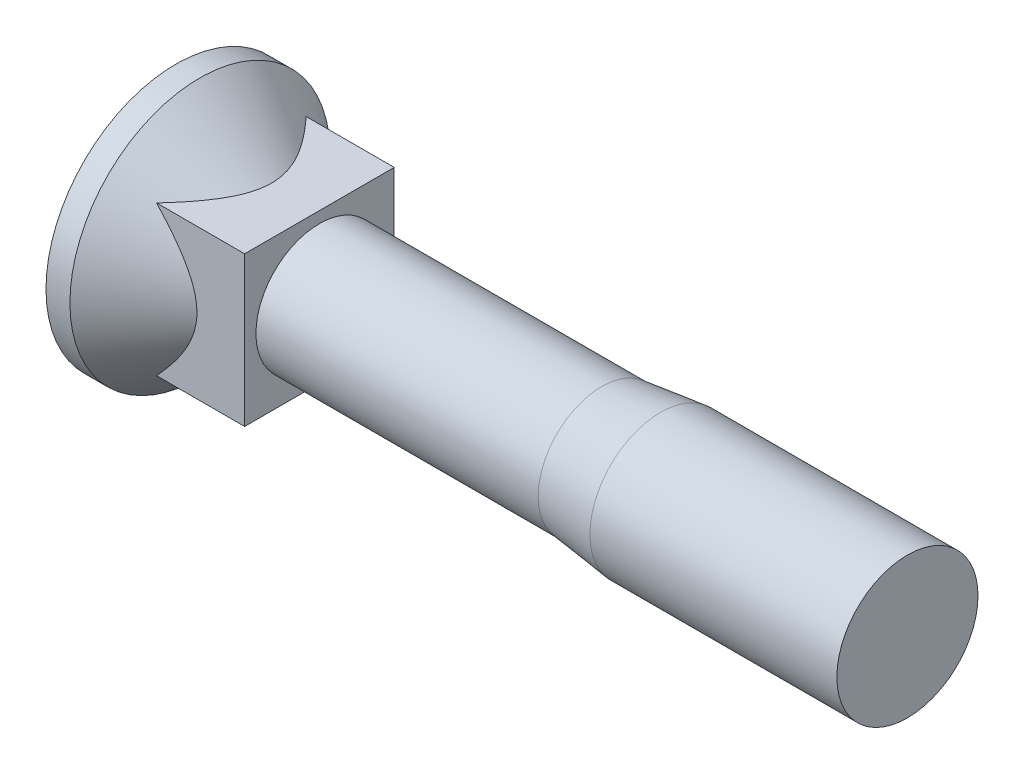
ISO-10303-21;
HEADER;
FILE_DESCRIPTION(('STEP AP214'),'2;1');
FILE_NAME('part.step','',(''),(''),'','','');
FILE_SCHEMA(('AUTOMOTIVE_DESIGN { 1 0 10303 214 1 1 1 1 }'));
ENDSEC;
DATA;
#1=APPLICATION_CONTEXT('core data for automotive mechanical design processes');
#2=APPLICATION_PROTOCOL_DEFINITION('international standard','automotive_design',2000,#1);
#3=PRODUCT_CONTEXT('',#1,'mechanical');
#4=PRODUCT('Part','Part','',(#3));
#5=PRODUCT_RELATED_PRODUCT_CATEGORY('part','',(#4));
#6=PRODUCT_DEFINITION_FORMATION('','',#4);
#7=PRODUCT_DEFINITION_CONTEXT('part definition',#1,'design');
#8=PRODUCT_DEFINITION('design','',#6,#7);
#9=PRODUCT_DEFINITION_SHAPE('','',#8);
#10=(LENGTH_UNIT() NAMED_UNIT(*) SI_UNIT(.MILLI.,.METRE.));
#11=(NAMED_UNIT(*) PLANE_ANGLE_UNIT() SI_UNIT($,.RADIAN.));
#12=(NAMED_UNIT(*) SI_UNIT($,.STERADIAN.) SOLID_ANGLE_UNIT());
#13=UNCERTAINTY_MEASURE_WITH_UNIT(LENGTH_MEASURE(1.E-05),#10,'distance_accuracy_value','');
#14=(GEOMETRIC_REPRESENTATION_CONTEXT(3) GLOBAL_UNCERTAINTY_ASSIGNED_CONTEXT((#13)) GLOBAL_UNIT_ASSIGNED_CONTEXT((#10,
#11,#12)) REPRESENTATION_CONTEXT('',''));
#15=CARTESIAN_POINT('',(0.,0.,0.));
#16=DIRECTION('',(0.,0.,1.));
#17=DIRECTION('',(1.,0.,0.));
#18=AXIS2_PLACEMENT_3D('',#15,#16,#17);
#19=CARTESIAN_POINT('',(6.1,-3.18,-3.18));
#20=DIRECTION('',(1.,0.,0.));
#21=DIRECTION('',(0.,0.,-1.));
#22=AXIS2_PLACEMENT_3D('',#19,#20,#21);
#23=PLANE('',#22);
#24=DIRECTION('',(0.,0.,-1.));
#25=VECTOR('',#24,1.);
#26=CARTESIAN_POINT('',(6.1,-3.18,3.18));
#27=LINE('',#26,#25);
#28=CARTESIAN_POINT('',(6.1,-3.18,3.18));
#29=VERTEX_POINT('',#28);
#30=CARTESIAN_POINT('',(6.1,-3.18,-3.18));
#31=VERTEX_POINT('',#30);
#32=EDGE_CURVE('E91',#29,#31,#27,.T.);
#33=ORIENTED_EDGE('',*,*,#32,.T.);
#34=DIRECTION('',(0.,1.,0.));
#35=VECTOR('',#34,1.);
#36=CARTESIAN_POINT('',(6.1,-3.18,-3.18));
#37=LINE('',#36,#35);
#38=CARTESIAN_POINT('',(6.1,3.18,-3.18));
#39=VERTEX_POINT('',#38);
#40=EDGE_CURVE('E98',#31,#39,#37,.T.);
#41=ORIENTED_EDGE('',*,*,#40,.T.);
#42=DIRECTION('',(0.,0.,1.));
#43=VECTOR('',#42,1.);
#44=CARTESIAN_POINT('',(6.1,3.18,-3.18));
#45=LINE('',#44,#43);
#46=CARTESIAN_POINT('',(6.1,3.18,3.18));
#47=VERTEX_POINT('',#46);
#48=EDGE_CURVE('E104',#39,#47,#45,.T.);
#49=ORIENTED_EDGE('',*,*,#48,.T.);
#50=DIRECTION('',(0.,-1.,0.));
#51=VECTOR('',#50,1.);
#52=CARTESIAN_POINT('',(6.1,3.18,3.18));
#53=LINE('',#52,#51);
#54=EDGE_CURVE('E95',#47,#29,#53,.T.);
#55=ORIENTED_EDGE('',*,*,#54,.T.);
#56=EDGE_LOOP('',(#33,#41,#49,#55));
#57=FACE_BOUND('',#56,.T.);
#58=CARTESIAN_POINT('',(6.09999999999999,0.,0.));
#59=DIRECTION('',(-1.,0.,0.));
#60=DIRECTION('',(0.,0.,1.));
#61=AXIS2_PLACEMENT_3D('',#58,#59,#60);
#62=CIRCLE('',#61,2.7);
#63=CARTESIAN_POINT('',(6.09999999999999,0.,2.7));
#64=VERTEX_POINT('',#63);
#65=EDGE_CURVE('E111',#64,#64,#62,.T.);
#66=ORIENTED_EDGE('',*,*,#65,.T.);
#67=EDGE_LOOP('',(#66));
#68=FACE_BOUND('',#67,.T.);
#69=ADVANCED_FACE('F43',(#57,#68),#23,.T.);
#70=CARTESIAN_POINT('',(7.55451395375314,0.,0.));
#71=DIRECTION('',(-1.,0.,0.));
#72=DIRECTION('',(0.,0.,1.));
#73=AXIS2_PLACEMENT_3D('',#70,#71,#72);
#74=CONICAL_SURFACE('',#73,0.5083333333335,0.654498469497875);
#75=CARTESIAN_POINT('',(-0.587061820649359,-5.96032861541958,-3.18));
#76=CARTESIAN_POINT('',(-0.434250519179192,-5.82740625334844,-3.18));
#77=CARTESIAN_POINT('',(-0.281904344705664,-5.69394400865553,-3.18));
#78=CARTESIAN_POINT('',(0.0216130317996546,-5.42565479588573,-3.18));
#79=CARTESIAN_POINT('',(0.172784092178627,-5.2908276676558,-3.18));
#80=CARTESIAN_POINT('',(0.474411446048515,-5.01888679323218,-3.18));
#81=CARTESIAN_POINT('',(0.624860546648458,-4.8817650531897,-3.18));
#82=CARTESIAN_POINT('',(0.923896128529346,-4.60551969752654,-3.18));
#83=CARTESIAN_POINT('',(1.07248271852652,-4.46639619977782,-3.18));
#84=CARTESIAN_POINT('',(1.37640790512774,-4.17696051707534,-3.18));
#85=CARTESIAN_POINT('',(1.53159514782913,-4.02648880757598,-3.18));
#86=CARTESIAN_POINT('',(1.83838047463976,-3.72194066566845,-3.18));
#87=CARTESIAN_POINT('',(1.98997881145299,-3.56786448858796,-3.18));
#88=CARTESIAN_POINT('',(2.28795853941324,-3.25529776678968,-3.18));
#89=CARTESIAN_POINT('',(2.43434990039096,-3.09681682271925,-3.18));
#90=CARTESIAN_POINT('',(2.64859665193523,-2.85441917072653,-3.18));
#91=CARTESIAN_POINT('',(2.71911133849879,-2.77285399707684,-3.18));
#92=CARTESIAN_POINT('',(2.85796496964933,-2.60789579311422,-3.18));
#93=CARTESIAN_POINT('',(2.92630404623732,-2.52450287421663,-3.18));
#94=CARTESIAN_POINT('',(3.07413489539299,-2.33816653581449,-3.18));
#95=CARTESIAN_POINT('',(3.15301992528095,-2.23473820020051,-3.18));
#96=CARTESIAN_POINT('',(3.3057396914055,-2.02412996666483,-3.18));
#97=CARTESIAN_POINT('',(3.37957244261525,-1.91694861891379,-3.18));
#98=CARTESIAN_POINT('',(3.51994233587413,-1.69898193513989,-3.18));
#99=CARTESIAN_POINT('',(3.58652982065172,-1.58822947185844,-3.18));
#100=CARTESIAN_POINT('',(3.71067784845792,-1.36184489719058,-3.18));
#101=CARTESIAN_POINT('',(3.76824500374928,-1.24621643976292,-3.18));
#102=CARTESIAN_POINT('',(3.88122105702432,-0.986803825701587,-3.18));
#103=CARTESIAN_POINT('',(3.93410952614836,-0.841865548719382,-3.18));
#104=CARTESIAN_POINT('',(3.99582538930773,-0.619704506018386,-3.18));
#105=CARTESIAN_POINT('',(4.01345661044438,-0.544898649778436,-3.18));
#106=CARTESIAN_POINT('',(4.04216313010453,-0.394054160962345,-3.18));
#107=CARTESIAN_POINT('',(4.05324179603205,-0.318016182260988,-3.18));
#108=CARTESIAN_POINT('',(4.06839690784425,-0.164522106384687,-3.18));
#109=CARTESIAN_POINT('',(4.07240718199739,-0.0870593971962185,-3.18));
#110=CARTESIAN_POINT('',(4.07301551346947,0.0678930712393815,-3.18));
#111=CARTESIAN_POINT('',(4.06961382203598,0.145382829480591,-3.18));
#112=CARTESIAN_POINT('',(4.05557098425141,0.299745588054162,-3.18));
#113=CARTESIAN_POINT('',(4.04492515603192,0.376618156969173,-3.18));
#114=CARTESIAN_POINT('',(4.01690678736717,0.529121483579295,-3.18));
#115=CARTESIAN_POINT('',(3.99953301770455,0.604752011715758,-3.18));
#116=CARTESIAN_POINT('',(3.95228844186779,0.778220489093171,-3.18));
#117=CARTESIAN_POINT('',(3.92019941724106,0.875453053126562,-3.18));
#118=CARTESIAN_POINT('',(3.84744106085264,1.06663892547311,-3.18));
#119=CARTESIAN_POINT('',(3.80676753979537,1.1605906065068,-3.18));
#120=CARTESIAN_POINT('',(3.71839117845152,1.34559035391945,-3.18));
#121=CARTESIAN_POINT('',(3.67065868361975,1.43662409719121,-3.18));
#122=CARTESIAN_POINT('',(3.56975924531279,1.61556442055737,-3.18));
#123=CARTESIAN_POINT('',(3.51659363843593,1.70347176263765,-3.18));
#124=CARTESIAN_POINT('',(3.36871070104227,1.93483104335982,-3.18));
#125=CARTESIAN_POINT('',(3.27012998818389,2.07580545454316,-3.18));
#126=CARTESIAN_POINT('',(3.06472533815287,2.35166049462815,-3.18));
#127=CARTESIAN_POINT('',(2.95789524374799,2.48653645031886,-3.18));
#128=CARTESIAN_POINT('',(2.73814807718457,2.75176694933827,-3.18));
#129=CARTESIAN_POINT('',(2.62521659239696,2.88210947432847,-3.18));
#130=CARTESIAN_POINT('',(2.39512654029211,3.13891471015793,-3.18));
#131=CARTESIAN_POINT('',(2.2779691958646,3.26537852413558,-3.18));
#132=CARTESIAN_POINT('',(2.03920912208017,3.5165627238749,-3.18));
#133=CARTESIAN_POINT('',(1.91757265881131,3.64125091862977,-3.18));
#134=CARTESIAN_POINT('',(1.67178358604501,3.88812902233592,-3.18));
#135=CARTESIAN_POINT('',(1.54763082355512,4.01031877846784,-3.18));
#136=CARTESIAN_POINT('',(1.29755607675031,4.25246662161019,-3.18));
#137=CARTESIAN_POINT('',(1.17163723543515,4.37242796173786,-3.18));
#138=CARTESIAN_POINT('',(0.918230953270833,4.61067105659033,-3.18));
#139=CARTESIAN_POINT('',(0.79074356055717,4.72895286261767,-3.18));
#140=CARTESIAN_POINT('',(0.41836371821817,5.07071792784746,-3.18));
#141=CARTESIAN_POINT('',(0.171797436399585,5.29237675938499,-3.18));
#142=CARTESIAN_POINT('',(-0.324555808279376,5.73206478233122,-3.18));
#143=CARTESIAN_POINT('',(-0.574342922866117,5.95009380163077,-3.18));
#144=CARTESIAN_POINT('',(-1.07630406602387,6.38345656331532,-3.18));
#145=CARTESIAN_POINT('',(-1.32847843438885,6.59878991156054,-3.18));
#146=CARTESIAN_POINT('',(-1.83459810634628,7.02736731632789,-3.18));
#147=CARTESIAN_POINT('',(-2.08854342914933,7.24061135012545,-3.18));
#148=CARTESIAN_POINT('',(-2.59811750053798,7.66572519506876,-3.18));
#149=CARTESIAN_POINT('',(-2.85374795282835,7.87759296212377,-3.18));
#150=CARTESIAN_POINT('',(-3.3660920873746,8.30001532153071,-3.18));
#151=CARTESIAN_POINT('',(-3.62280577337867,8.51056990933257,-3.18));
#152=CARTESIAN_POINT('',(-4.39419208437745,9.14061242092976,-3.18));
#153=CARTESIAN_POINT('',(-4.91015683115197,9.55851801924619,-3.18));
#154=CARTESIAN_POINT('',(-5.90660386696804,10.3610193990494,-3.18));
#155=CARTESIAN_POINT('',(-6.38692356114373,10.7458175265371,-3.18));
#156=CARTESIAN_POINT('',(-7.3490257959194,11.5136070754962,-3.18));
#157=CARTESIAN_POINT('',(-7.8308083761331,11.8965984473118,-3.18));
#158=CARTESIAN_POINT('',(-8.79453942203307,12.6604941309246,-3.18));
#159=CARTESIAN_POINT('',(-9.2764858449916,13.04140102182,-3.18));
#160=CARTESIAN_POINT('',(-10.2412041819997,13.8021347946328,-3.18));
#161=CARTESIAN_POINT('',(-10.7239760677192,14.1819617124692,-3.18));
#162=CARTESIAN_POINT('',(-11.2070519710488,14.561400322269,-3.18));
#163=B_SPLINE_CURVE_WITH_KNOTS('',3,(#75,#76,#77,#78,#79,#80,#81,#82,#83,#84,#85,#86,#87,#88,
#89,#90,#91,#92,#93,#94,#95,#96,#97,#98,#99,#100,#101,#102,#103,#104,#105,#106,#107,#108,#109,
#110,#111,#112,#113,#114,#115,#116,#117,#118,#119,#120,#121,#122,#123,#124,#125,#126,#127,#128,
#129,#130,#131,#132,#133,#134,#135,#136,#137,#138,#139,#140,#141,#142,#143,#144,#145,#146,#147,
#148,#149,#150,#151,#152,#153,#154,#155,#156,#157,#158,#159,#160,#161,#162),.UNSPECIFIED.,.F.,
.F.,(4,2,2,2,2,2,2,2,2,2,2,2,2,2,2,2,2,2,2,2,2,2,2,2,2,2,2,2,2,2,2,2,2,2,2,2,2,2,2,2,2,2,2,4),
(0.,0.607603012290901,1.21527816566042,1.82594774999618,2.4365815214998,3.08501233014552,
3.73339734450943,4.38046555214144,4.70389623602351,5.02730725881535,5.41742002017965,
5.80768518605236,6.19503731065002,6.58210414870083,7.04323038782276,7.27355431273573,
7.50375976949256,7.73610910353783,7.96845056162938,8.20094232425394,8.43347658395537,
8.74012953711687,9.04693248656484,9.35506298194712,9.6631178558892,10.1787057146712,
10.6946821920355,11.211935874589,11.7290410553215,12.2515690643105,12.7741289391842,
13.2958540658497,13.8175632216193,14.8121653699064,15.8068145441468,16.8016074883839,
17.7964112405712,18.7924549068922,19.788502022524,21.7804134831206,23.6267537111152,
25.4731443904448,27.3160377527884,29.1588690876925),.UNSPECIFIED.);
#164=CARTESIAN_POINT('',(2.35612284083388,3.18,-3.18));
#165=VERTEX_POINT('',#164);
#166=CARTESIAN_POINT('',(2.35612284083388,-3.18,-3.18));
#167=VERTEX_POINT('',#166);
#168=EDGE_CURVE('E128',#165,#167,#163,.F.);
#169=ORIENTED_EDGE('',*,*,#168,.T.);
#170=CARTESIAN_POINT('',(-0.58706182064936,-3.18,-5.96032861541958));
#171=CARTESIAN_POINT('',(-0.434250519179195,-3.18,-5.82740625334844));
#172=CARTESIAN_POINT('',(-0.281904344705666,-3.18,-5.69394400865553));
#173=CARTESIAN_POINT('',(0.021613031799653,-3.18,-5.42565479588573));
#174=CARTESIAN_POINT('',(0.172784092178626,-3.18,-5.29082766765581));
#175=CARTESIAN_POINT('',(0.474411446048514,-3.18,-5.01888679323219));
#176=CARTESIAN_POINT('',(0.624860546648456,-3.18,-4.8817650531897));
#177=CARTESIAN_POINT('',(0.923896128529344,-3.18,-4.60551969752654));
#178=CARTESIAN_POINT('',(1.07248271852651,-3.18,-4.46639619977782));
#179=CARTESIAN_POINT('',(1.37640790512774,-3.18,-4.17696051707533));
#180=CARTESIAN_POINT('',(1.53159514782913,-3.18,-4.02648880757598));
#181=CARTESIAN_POINT('',(1.83838047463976,-3.18,-3.72194066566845));
#182=CARTESIAN_POINT('',(1.98997881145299,-3.18,-3.56786448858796));
#183=CARTESIAN_POINT('',(2.28795853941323,-3.18,-3.25529776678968));
#184=CARTESIAN_POINT('',(2.43434990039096,-3.18,-3.09681682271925));
#185=CARTESIAN_POINT('',(2.64859665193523,-3.18,-2.85441917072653));
#186=CARTESIAN_POINT('',(2.71911133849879,-3.18,-2.77285399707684));
#187=CARTESIAN_POINT('',(2.85796496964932,-3.18,-2.60789579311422));
#188=CARTESIAN_POINT('',(2.92630404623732,-3.18,-2.52450287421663));
#189=CARTESIAN_POINT('',(3.07413489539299,-3.18,-2.33816653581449));
#190=CARTESIAN_POINT('',(3.15301992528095,-3.18,-2.23473820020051));
#191=CARTESIAN_POINT('',(3.3057396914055,-3.18,-2.02412996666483));
#192=CARTESIAN_POINT('',(3.37957244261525,-3.18,-1.91694861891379));
#193=CARTESIAN_POINT('',(3.51994233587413,-3.18,-1.69898193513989));
#194=CARTESIAN_POINT('',(3.58652982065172,-3.18,-1.58822947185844));
#195=CARTESIAN_POINT('',(3.71067784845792,-3.18,-1.36184489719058));
#196=CARTESIAN_POINT('',(3.76824500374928,-3.18,-1.24621643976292));
#197=CARTESIAN_POINT('',(3.88122105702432,-3.18,-0.986803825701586));
#198=CARTESIAN_POINT('',(3.93410952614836,-3.18,-0.84186554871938));
#199=CARTESIAN_POINT('',(3.99582538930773,-3.18,-0.619704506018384));
#200=CARTESIAN_POINT('',(4.01345661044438,-3.18,-0.544898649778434));
#201=CARTESIAN_POINT('',(4.04216313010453,-3.18,-0.394054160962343));
#202=CARTESIAN_POINT('',(4.05324179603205,-3.18,-0.318016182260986));
#203=CARTESIAN_POINT('',(4.06839690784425,-3.18,-0.164522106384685));
#204=CARTESIAN_POINT('',(4.07240718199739,-3.18,-0.0870593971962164));
#205=CARTESIAN_POINT('',(4.07301551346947,-3.18,0.0678930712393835));
#206=CARTESIAN_POINT('',(4.06961382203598,-3.18,0.145382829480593));
#207=CARTESIAN_POINT('',(4.0555709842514,-3.18,0.299745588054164));
#208=CARTESIAN_POINT('',(4.04492515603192,-3.18,0.376618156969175));
#209=CARTESIAN_POINT('',(4.01690678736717,-3.18,0.529121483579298));
#210=CARTESIAN_POINT('',(3.99953301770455,-3.18,0.60475201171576));
#211=CARTESIAN_POINT('',(3.95228844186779,-3.18,0.778220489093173));
#212=CARTESIAN_POINT('',(3.92019941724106,-3.18,0.875453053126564));
#213=CARTESIAN_POINT('',(3.84744106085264,-3.18,1.06663892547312));
#214=CARTESIAN_POINT('',(3.80676753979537,-3.18,1.1605906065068));
#215=CARTESIAN_POINT('',(3.71839117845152,-3.18,1.34559035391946));
#216=CARTESIAN_POINT('',(3.67065868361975,-3.18,1.43662409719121));
#217=CARTESIAN_POINT('',(3.56975924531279,-3.18,1.61556442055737));
#218=CARTESIAN_POINT('',(3.51659363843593,-3.18,1.70347176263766));
#219=CARTESIAN_POINT('',(3.36871070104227,-3.18,1.93483104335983));
#220=CARTESIAN_POINT('',(3.27012998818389,-3.18,2.07580545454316));
#221=CARTESIAN_POINT('',(3.06472533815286,-3.18,2.35166049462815));
#222=CARTESIAN_POINT('',(2.95789524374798,-3.18,2.48653645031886));
#223=CARTESIAN_POINT('',(2.73814807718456,-3.18,2.75176694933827));
#224=CARTESIAN_POINT('',(2.62521659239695,-3.18,2.88210947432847));
#225=CARTESIAN_POINT('',(2.3951265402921,-3.18,3.13891471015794));
#226=CARTESIAN_POINT('',(2.2779691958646,-3.18,3.26537852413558));
#227=CARTESIAN_POINT('',(2.03920912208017,-3.18,3.51656272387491));
#228=CARTESIAN_POINT('',(1.9175726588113,-3.18,3.64125091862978));
#229=CARTESIAN_POINT('',(1.671783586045,-3.18,3.88812902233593));
#230=CARTESIAN_POINT('',(1.54763082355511,-3.18,4.01031877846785));
#231=CARTESIAN_POINT('',(1.2975560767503,-3.18,4.2524666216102));
#232=CARTESIAN_POINT('',(1.17163723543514,-3.18,4.37242796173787));
#233=CARTESIAN_POINT('',(0.918230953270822,-3.18,4.61067105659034));
#234=CARTESIAN_POINT('',(0.790743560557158,-3.18,4.72895286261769));
#235=CARTESIAN_POINT('',(0.418363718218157,-3.18,5.07071792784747));
#236=CARTESIAN_POINT('',(0.171797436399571,-3.18,5.292376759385));
#237=CARTESIAN_POINT('',(-0.324555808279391,-3.18,5.73206478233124));
#238=CARTESIAN_POINT('',(-0.574342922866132,-3.18,5.95009380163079));
#239=CARTESIAN_POINT('',(-1.07630406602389,-3.18,6.38345656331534));
#240=CARTESIAN_POINT('',(-1.32847843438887,-3.18,6.59878991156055));
#241=CARTESIAN_POINT('',(-1.8345981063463,-3.18,7.02736731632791));
#242=CARTESIAN_POINT('',(-2.08854342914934,-3.18,7.24061135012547));
#243=CARTESIAN_POINT('',(-2.598117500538,-3.18,7.66572519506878));
#244=CARTESIAN_POINT('',(-2.85374795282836,-3.18,7.87759296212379));
#245=CARTESIAN_POINT('',(-3.36609208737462,-3.18,8.30001532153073));
#246=CARTESIAN_POINT('',(-3.62280577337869,-3.18,8.51056990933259));
#247=CARTESIAN_POINT('',(-4.39419208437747,-3.18,9.14061242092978));
#248=CARTESIAN_POINT('',(-4.91015683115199,-3.18,9.55851801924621));
#249=CARTESIAN_POINT('',(-5.90660386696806,-3.18,10.3610193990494));
#250=CARTESIAN_POINT('',(-6.38692356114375,-3.18,10.7458175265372));
#251=CARTESIAN_POINT('',(-7.34902579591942,-3.18,11.5136070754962));
#252=CARTESIAN_POINT('',(-7.83080837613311,-3.18,11.8965984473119));
#253=CARTESIAN_POINT('',(-8.79453942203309,-3.18,12.6604941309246));
#254=CARTESIAN_POINT('',(-9.27648584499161,-3.18,13.0414010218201));
#255=CARTESIAN_POINT('',(-10.2412041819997,-3.18,13.8021347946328));
#256=CARTESIAN_POINT('',(-10.7239760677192,-3.18,14.1819617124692));
#257=CARTESIAN_POINT('',(-11.2070519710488,-3.18,14.561400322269));
#258=B_SPLINE_CURVE_WITH_KNOTS('',3,(#170,#171,#172,#173,#174,#175,#176,#177,#178,#179,#180,
#181,#182,#183,#184,#185,#186,#187,#188,#189,#190,#191,#192,#193,#194,#195,#196,#197,#198,#199,
#200,#201,#202,#203,#204,#205,#206,#207,#208,#209,#210,#211,#212,#213,#214,#215,#216,#217,#218,
#219,#220,#221,#222,#223,#224,#225,#226,#227,#228,#229,#230,#231,#232,#233,#234,#235,#236,#237,
#238,#239,#240,#241,#242,#243,#244,#245,#246,#247,#248,#249,#250,#251,#252,#253,#254,#255,#256,
#257),.UNSPECIFIED.,.F.,.F.,(4,2,2,2,2,2,2,2,2,2,2,2,2,2,2,2,2,2,2,2,2,2,2,2,2,2,2,2,2,2,2,2,2,
2,2,2,2,2,2,2,2,2,2,4),(0.,0.607603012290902,1.21527816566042,1.82594774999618,2.4365815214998,
3.08501233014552,3.73339734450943,4.38046555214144,4.70389623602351,5.02730725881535,
5.41742002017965,5.80768518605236,6.19503731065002,6.58210414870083,7.04323038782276,
7.27355431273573,7.50375976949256,7.73610910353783,7.96845056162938,8.20094232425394,
8.43347658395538,8.74012953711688,9.04693248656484,9.35506298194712,9.66311785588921,
10.1787057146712,10.6946821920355,11.211935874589,11.7290410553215,12.2515690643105,
12.7741289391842,13.2958540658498,13.8175632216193,14.8121653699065,15.8068145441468,
16.8016074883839,17.7964112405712,18.7924549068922,19.788502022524,21.7804134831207,
23.6267537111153,25.4731443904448,27.3160377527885,29.1588690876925),.UNSPECIFIED.);
#259=CARTESIAN_POINT('',(2.35612284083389,-3.18,3.18));
#260=VERTEX_POINT('',#259);
#261=EDGE_CURVE('E11',#167,#260,#258,.T.);
#262=ORIENTED_EDGE('',*,*,#261,.T.);
#263=CARTESIAN_POINT('',(-0.587061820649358,-5.96032861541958,3.18));
#264=CARTESIAN_POINT('',(-0.434250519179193,-5.82740625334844,3.18));
#265=CARTESIAN_POINT('',(-0.281904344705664,-5.69394400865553,3.18));
#266=CARTESIAN_POINT('',(0.0216130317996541,-5.42565479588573,3.18));
#267=CARTESIAN_POINT('',(0.172784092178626,-5.29082766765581,3.18));
#268=CARTESIAN_POINT('',(0.474411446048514,-5.01888679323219,3.18));
#269=CARTESIAN_POINT('',(0.624860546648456,-4.8817650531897,3.18));
#270=CARTESIAN_POINT('',(0.923896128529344,-4.60551969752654,3.18));
#271=CARTESIAN_POINT('',(1.07248271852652,-4.46639619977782,3.18));
#272=CARTESIAN_POINT('',(1.37640790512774,-4.17696051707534,3.18));
#273=CARTESIAN_POINT('',(1.53159514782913,-4.02648880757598,3.18));
#274=CARTESIAN_POINT('',(1.83838047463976,-3.72194066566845,3.18));
#275=CARTESIAN_POINT('',(1.98997881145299,-3.56786448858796,3.18));
#276=CARTESIAN_POINT('',(2.28795853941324,-3.25529776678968,3.18));
#277=CARTESIAN_POINT('',(2.43434990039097,-3.09681682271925,3.18));
#278=CARTESIAN_POINT('',(2.64859665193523,-2.85441917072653,3.18));
#279=CARTESIAN_POINT('',(2.71911133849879,-2.77285399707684,3.18));
#280=CARTESIAN_POINT('',(2.85796496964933,-2.60789579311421,3.18));
#281=CARTESIAN_POINT('',(2.92630404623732,-2.52450287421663,3.18));
#282=CARTESIAN_POINT('',(3.07413489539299,-2.33816653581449,3.18));
#283=CARTESIAN_POINT('',(3.15301992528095,-2.23473820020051,3.18));
#284=CARTESIAN_POINT('',(3.3057396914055,-2.02412996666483,3.18));
#285=CARTESIAN_POINT('',(3.37957244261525,-1.91694861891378,3.18));
#286=CARTESIAN_POINT('',(3.51994233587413,-1.69898193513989,3.18));
#287=CARTESIAN_POINT('',(3.58652982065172,-1.58822947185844,3.18));
#288=CARTESIAN_POINT('',(3.71067784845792,-1.36184489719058,3.18));
#289=CARTESIAN_POINT('',(3.76824500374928,-1.24621643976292,3.18));
#290=CARTESIAN_POINT('',(3.88122105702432,-0.986803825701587,3.18));
#291=CARTESIAN_POINT('',(3.93410952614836,-0.841865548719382,3.18));
#292=CARTESIAN_POINT('',(3.99582538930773,-0.619704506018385,3.18));
#293=CARTESIAN_POINT('',(4.01345661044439,-0.544898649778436,3.18));
#294=CARTESIAN_POINT('',(4.04216313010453,-0.394054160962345,3.18));
#295=CARTESIAN_POINT('',(4.05324179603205,-0.318016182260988,3.18));
#296=CARTESIAN_POINT('',(4.06839690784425,-0.164522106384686,3.18));
#297=CARTESIAN_POINT('',(4.07240718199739,-0.0870593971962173,3.18));
#298=CARTESIAN_POINT('',(4.07301551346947,0.0678930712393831,3.18));
#299=CARTESIAN_POINT('',(4.06961382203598,0.145382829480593,3.18));
#300=CARTESIAN_POINT('',(4.05557098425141,0.299745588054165,3.18));
#301=CARTESIAN_POINT('',(4.04492515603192,0.376618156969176,3.18));
#302=CARTESIAN_POINT('',(4.01690678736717,0.529121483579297,3.18));
#303=CARTESIAN_POINT('',(3.99953301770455,0.60475201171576,3.18));
#304=CARTESIAN_POINT('',(3.95228844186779,0.778220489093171,3.18));
#305=CARTESIAN_POINT('',(3.92019941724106,0.875453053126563,3.18));
#306=CARTESIAN_POINT('',(3.84744106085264,1.06663892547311,3.18));
#307=CARTESIAN_POINT('',(3.80676753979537,1.1605906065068,3.18));
#308=CARTESIAN_POINT('',(3.71839117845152,1.34559035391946,3.18));
#309=CARTESIAN_POINT('',(3.67065868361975,1.43662409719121,3.18));
#310=CARTESIAN_POINT('',(3.56975924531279,1.61556442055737,3.18));
#311=CARTESIAN_POINT('',(3.51659363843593,1.70347176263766,3.18));
#312=CARTESIAN_POINT('',(3.36871070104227,1.93483104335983,3.18));
#313=CARTESIAN_POINT('',(3.27012998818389,2.07580545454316,3.18));
#314=CARTESIAN_POINT('',(3.06472533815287,2.35166049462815,3.18));
#315=CARTESIAN_POINT('',(2.95789524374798,2.48653645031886,3.18));
#316=CARTESIAN_POINT('',(2.73814807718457,2.75176694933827,3.18));
#317=CARTESIAN_POINT('',(2.62521659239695,2.88210947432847,3.18));
#318=CARTESIAN_POINT('',(2.3951265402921,3.13891471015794,3.18));
#319=CARTESIAN_POINT('',(2.2779691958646,3.26537852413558,3.18));
#320=CARTESIAN_POINT('',(2.03920912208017,3.51656272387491,3.18));
#321=CARTESIAN_POINT('',(1.9175726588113,3.64125091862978,3.18));
#322=CARTESIAN_POINT('',(1.671783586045,3.88812902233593,3.18));
#323=CARTESIAN_POINT('',(1.54763082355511,4.01031877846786,3.18));
#324=CARTESIAN_POINT('',(1.2975560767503,4.2524666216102,3.18));
#325=CARTESIAN_POINT('',(1.17163723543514,4.37242796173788,3.18));
#326=CARTESIAN_POINT('',(0.91823095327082,4.61067105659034,3.18));
#327=CARTESIAN_POINT('',(0.790743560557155,4.72895286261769,3.18));
#328=CARTESIAN_POINT('',(0.418363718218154,5.07071792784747,3.18));
#329=CARTESIAN_POINT('',(0.171797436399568,5.29237675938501,3.18));
#330=CARTESIAN_POINT('',(-0.324555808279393,5.73206478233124,3.18));
#331=CARTESIAN_POINT('',(-0.574342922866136,5.95009380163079,3.18));
#332=CARTESIAN_POINT('',(-1.07630406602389,6.38345656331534,3.18));
#333=CARTESIAN_POINT('',(-1.32847843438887,6.59878991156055,3.18));
#334=CARTESIAN_POINT('',(-1.8345981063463,7.0273673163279,3.18));
#335=CARTESIAN_POINT('',(-2.08854342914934,7.24061135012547,3.18));
#336=CARTESIAN_POINT('',(-2.598117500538,7.66572519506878,3.18));
#337=CARTESIAN_POINT('',(-2.85374795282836,7.87759296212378,3.18));
#338=CARTESIAN_POINT('',(-3.36609208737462,8.30001532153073,3.18));
#339=CARTESIAN_POINT('',(-3.62280577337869,8.51056990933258,3.18));
#340=CARTESIAN_POINT('',(-4.39419208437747,9.14061242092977,3.18));
#341=CARTESIAN_POINT('',(-4.91015683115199,9.55851801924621,3.18));
#342=CARTESIAN_POINT('',(-5.90660386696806,10.3610193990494,3.18));
#343=CARTESIAN_POINT('',(-6.38692356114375,10.7458175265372,3.18));
#344=CARTESIAN_POINT('',(-7.34902579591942,11.5136070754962,3.18));
#345=CARTESIAN_POINT('',(-7.83080837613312,11.8965984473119,3.18));
#346=CARTESIAN_POINT('',(-8.79453942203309,12.6604941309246,3.18));
#347=CARTESIAN_POINT('',(-9.27648584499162,13.0414010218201,3.18));
#348=CARTESIAN_POINT('',(-10.2412041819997,13.8021347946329,3.18));
#349=CARTESIAN_POINT('',(-10.7239760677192,14.1819617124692,3.18));
#350=CARTESIAN_POINT('',(-11.2070519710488,14.561400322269,3.18));
#351=B_SPLINE_CURVE_WITH_KNOTS('',3,(#263,#264,#265,#266,#267,#268,#269,#270,#271,#272,#273,
#274,#275,#276,#277,#278,#279,#280,#281,#282,#283,#284,#285,#286,#287,#288,#289,#290,#291,#292,
#293,#294,#295,#296,#297,#298,#299,#300,#301,#302,#303,#304,#305,#306,#307,#308,#309,#310,#311,
#312,#313,#314,#315,#316,#317,#318,#319,#320,#321,#322,#323,#324,#325,#326,#327,#328,#329,#330,
#331,#332,#333,#334,#335,#336,#337,#338,#339,#340,#341,#342,#343,#344,#345,#346,#347,#348,#349,
#350),.UNSPECIFIED.,.F.,.F.,(4,2,2,2,2,2,2,2,2,2,2,2,2,2,2,2,2,2,2,2,2,2,2,2,2,2,2,2,2,2,2,2,2,
2,2,2,2,2,2,2,2,2,2,4),(0.,0.6076030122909,1.21527816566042,1.82594774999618,2.4365815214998,
3.08501233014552,3.73339734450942,4.38046555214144,4.70389623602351,5.02730725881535,
5.41742002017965,5.80768518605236,6.19503731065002,6.58210414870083,7.04323038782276,
7.27355431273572,7.50375976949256,7.73610910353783,7.96845056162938,8.20094232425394,
8.43347658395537,8.74012953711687,9.04693248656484,9.35506298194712,9.6631178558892,
10.1787057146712,10.6946821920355,11.211935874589,11.7290410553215,12.2515690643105,
12.7741289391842,13.2958540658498,13.8175632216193,14.8121653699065,15.8068145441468,
16.801607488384,17.7964112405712,18.7924549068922,19.788502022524,21.7804134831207,
23.6267537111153,25.4731443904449,27.3160377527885,29.1588690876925),.UNSPECIFIED.);
#352=CARTESIAN_POINT('',(2.35612284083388,3.18,3.18));
#353=VERTEX_POINT('',#352);
#354=EDGE_CURVE('E57',#260,#353,#351,.T.);
#355=ORIENTED_EDGE('',*,*,#354,.T.);
#356=CARTESIAN_POINT('',(-0.587061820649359,3.18,-5.96032861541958));
#357=CARTESIAN_POINT('',(-0.434250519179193,3.18,-5.82740625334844));
#358=CARTESIAN_POINT('',(-0.281904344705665,3.18,-5.69394400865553));
#359=CARTESIAN_POINT('',(0.0216130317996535,3.18,-5.42565479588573));
#360=CARTESIAN_POINT('',(0.172784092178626,3.18,-5.29082766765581));
#361=CARTESIAN_POINT('',(0.474411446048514,3.18,-5.01888679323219));
#362=CARTESIAN_POINT('',(0.624860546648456,3.18,-4.8817650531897));
#363=CARTESIAN_POINT('',(0.923896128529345,3.18,-4.60551969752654));
#364=CARTESIAN_POINT('',(1.07248271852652,3.18,-4.46639619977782));
#365=CARTESIAN_POINT('',(1.37640790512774,3.18,-4.17696051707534));
#366=CARTESIAN_POINT('',(1.53159514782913,3.18,-4.02648880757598));
#367=CARTESIAN_POINT('',(1.83838047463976,3.18,-3.72194066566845));
#368=CARTESIAN_POINT('',(1.98997881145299,3.18,-3.56786448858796));
#369=CARTESIAN_POINT('',(2.28795853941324,3.18,-3.25529776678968));
#370=CARTESIAN_POINT('',(2.43434990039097,3.18,-3.09681682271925));
#371=CARTESIAN_POINT('',(2.64859665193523,3.18,-2.85441917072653));
#372=CARTESIAN_POINT('',(2.71911133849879,3.18,-2.77285399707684));
#373=CARTESIAN_POINT('',(2.85796496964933,3.18,-2.60789579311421));
#374=CARTESIAN_POINT('',(2.92630404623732,3.18,-2.52450287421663));
#375=CARTESIAN_POINT('',(3.07413489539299,3.18,-2.33816653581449));
#376=CARTESIAN_POINT('',(3.15301992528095,3.18,-2.23473820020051));
#377=CARTESIAN_POINT('',(3.3057396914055,3.18,-2.02412996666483));
#378=CARTESIAN_POINT('',(3.37957244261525,3.18,-1.91694861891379));
#379=CARTESIAN_POINT('',(3.51994233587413,3.18,-1.69898193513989));
#380=CARTESIAN_POINT('',(3.58652982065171,3.18,-1.58822947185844));
#381=CARTESIAN_POINT('',(3.71067784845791,3.18,-1.36184489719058));
#382=CARTESIAN_POINT('',(3.76824500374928,3.18,-1.24621643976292));
#383=CARTESIAN_POINT('',(3.88122105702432,3.18,-0.986803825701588));
#384=CARTESIAN_POINT('',(3.93410952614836,3.18,-0.841865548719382));
#385=CARTESIAN_POINT('',(3.99582538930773,3.18,-0.619704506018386));
#386=CARTESIAN_POINT('',(4.01345661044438,3.18,-0.544898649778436));
#387=CARTESIAN_POINT('',(4.04216313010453,3.18,-0.394054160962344));
#388=CARTESIAN_POINT('',(4.05324179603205,3.18,-0.318016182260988));
#389=CARTESIAN_POINT('',(4.06839690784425,3.18,-0.164522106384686));
#390=CARTESIAN_POINT('',(4.07240718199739,3.18,-0.0870593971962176));
#391=CARTESIAN_POINT('',(4.07301551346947,3.18,0.0678930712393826));
#392=CARTESIAN_POINT('',(4.06961382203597,3.18,0.145382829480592));
#393=CARTESIAN_POINT('',(4.0555709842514,3.18,0.299745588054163));
#394=CARTESIAN_POINT('',(4.04492515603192,3.18,0.376618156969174));
#395=CARTESIAN_POINT('',(4.01690678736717,3.18,0.529121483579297));
#396=CARTESIAN_POINT('',(3.99953301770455,3.18,0.60475201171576));
#397=CARTESIAN_POINT('',(3.95228844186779,3.18,0.778220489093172));
#398=CARTESIAN_POINT('',(3.92019941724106,3.18,0.875453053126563));
#399=CARTESIAN_POINT('',(3.84744106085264,3.18,1.06663892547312));
#400=CARTESIAN_POINT('',(3.80676753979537,3.18,1.1605906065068));
#401=CARTESIAN_POINT('',(3.71839117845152,3.18,1.34559035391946));
#402=CARTESIAN_POINT('',(3.67065868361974,3.18,1.43662409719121));
#403=CARTESIAN_POINT('',(3.56975924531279,3.18,1.61556442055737));
#404=CARTESIAN_POINT('',(3.51659363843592,3.18,1.70347176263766));
#405=CARTESIAN_POINT('',(3.36871070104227,3.18,1.93483104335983));
#406=CARTESIAN_POINT('',(3.27012998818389,3.18,2.07580545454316));
#407=CARTESIAN_POINT('',(3.06472533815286,3.18,2.35166049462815));
#408=CARTESIAN_POINT('',(2.95789524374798,3.18,2.48653645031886));
#409=CARTESIAN_POINT('',(2.73814807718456,3.18,2.75176694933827));
#410=CARTESIAN_POINT('',(2.62521659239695,3.18,2.88210947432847));
#411=CARTESIAN_POINT('',(2.3951265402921,3.18,3.13891471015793));
#412=CARTESIAN_POINT('',(2.27796919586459,3.18,3.26537852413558));
#413=CARTESIAN_POINT('',(2.03920912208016,3.18,3.51656272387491));
#414=CARTESIAN_POINT('',(1.9175726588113,3.18,3.64125091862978));
#415=CARTESIAN_POINT('',(1.671783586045,3.18,3.88812902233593));
#416=CARTESIAN_POINT('',(1.54763082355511,3.18,4.01031877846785));
#417=CARTESIAN_POINT('',(1.2975560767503,3.18,4.2524666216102));
#418=CARTESIAN_POINT('',(1.17163723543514,3.18,4.37242796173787));
#419=CARTESIAN_POINT('',(0.91823095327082,3.18,4.61067105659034));
#420=CARTESIAN_POINT('',(0.790743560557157,3.18,4.72895286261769));
#421=CARTESIAN_POINT('',(0.418363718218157,3.18,5.07071792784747));
#422=CARTESIAN_POINT('',(0.171797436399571,3.18,5.292376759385));
#423=CARTESIAN_POINT('',(-0.32455580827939,3.18,5.73206478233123));
#424=CARTESIAN_POINT('',(-0.574342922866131,3.18,5.95009380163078));
#425=CARTESIAN_POINT('',(-1.07630406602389,3.18,6.38345656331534));
#426=CARTESIAN_POINT('',(-1.32847843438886,3.18,6.59878991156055));
#427=CARTESIAN_POINT('',(-1.83459810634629,3.18,7.0273673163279));
#428=CARTESIAN_POINT('',(-2.08854342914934,3.18,7.24061135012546));
#429=CARTESIAN_POINT('',(-2.59811750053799,3.18,7.66572519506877));
#430=CARTESIAN_POINT('',(-2.85374795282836,3.18,7.87759296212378));
#431=CARTESIAN_POINT('',(-3.36609208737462,3.18,8.30001532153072));
#432=CARTESIAN_POINT('',(-3.62280577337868,3.18,8.51056990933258));
#433=CARTESIAN_POINT('',(-4.39419208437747,3.18,9.14061242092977));
#434=CARTESIAN_POINT('',(-4.91015683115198,3.18,9.5585180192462));
#435=CARTESIAN_POINT('',(-5.90660386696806,3.18,10.3610193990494));
#436=CARTESIAN_POINT('',(-6.38692356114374,3.18,10.7458175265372));
#437=CARTESIAN_POINT('',(-7.34902579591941,3.18,11.5136070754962));
#438=CARTESIAN_POINT('',(-7.83080837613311,3.18,11.8965984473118));
#439=CARTESIAN_POINT('',(-8.79453942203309,3.18,12.6604941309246));
#440=CARTESIAN_POINT('',(-9.27648584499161,3.18,13.0414010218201));
#441=CARTESIAN_POINT('',(-10.2412041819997,3.18,13.8021347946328));
#442=CARTESIAN_POINT('',(-10.7239760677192,3.18,14.1819617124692));
#443=CARTESIAN_POINT('',(-11.2070519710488,3.18,14.561400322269));
#444=B_SPLINE_CURVE_WITH_KNOTS('',3,(#356,#357,#358,#359,#360,#361,#362,#363,#364,#365,#366,
#367,#368,#369,#370,#371,#372,#373,#374,#375,#376,#377,#378,#379,#380,#381,#382,#383,#384,#385,
#386,#387,#388,#389,#390,#391,#392,#393,#394,#395,#396,#397,#398,#399,#400,#401,#402,#403,#404,
#405,#406,#407,#408,#409,#410,#411,#412,#413,#414,#415,#416,#417,#418,#419,#420,#421,#422,#423,
#424,#425,#426,#427,#428,#429,#430,#431,#432,#433,#434,#435,#436,#437,#438,#439,#440,#441,#442,
#443),.UNSPECIFIED.,.F.,.F.,(4,2,2,2,2,2,2,2,2,2,2,2,2,2,2,2,2,2,2,2,2,2,2,2,2,2,2,2,2,2,2,2,2,
2,2,2,2,2,2,2,2,2,2,4),(0.,0.6076030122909,1.21527816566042,1.82594774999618,2.4365815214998,
3.08501233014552,3.73339734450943,4.38046555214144,4.70389623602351,5.02730725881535,
5.41742002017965,5.80768518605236,6.19503731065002,6.58210414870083,7.04323038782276,
7.27355431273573,7.50375976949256,7.73610910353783,7.96845056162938,8.20094232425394,
8.43347658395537,8.74012953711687,9.04693248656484,9.35506298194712,9.6631178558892,
10.1787057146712,10.6946821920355,11.211935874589,11.7290410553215,12.2515690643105,
12.7741289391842,13.2958540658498,13.8175632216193,14.8121653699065,15.8068145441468,
16.8016074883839,17.7964112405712,18.7924549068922,19.788502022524,21.7804134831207,
23.6267537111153,25.4731443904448,27.3160377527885,29.1588690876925),.UNSPECIFIED.);
#445=EDGE_CURVE('E135',#353,#165,#444,.F.);
#446=ORIENTED_EDGE('',*,*,#445,.T.);
#447=EDGE_LOOP('',(#169,#262,#355,#446));
#448=FACE_BOUND('',#447,.T.);
#449=CARTESIAN_POINT('',(1.01666666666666,0.,0.));
#450=DIRECTION('',(-1.,0.,0.));
#451=DIRECTION('',(0.,0.,1.));
#452=AXIS2_PLACEMENT_3D('',#449,#450,#451);
#453=CIRCLE('',#452,5.525);
#454=CARTESIAN_POINT('',(1.01666666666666,0.,5.525));
#455=VERTEX_POINT('',#454);
#456=EDGE_CURVE('E119',#455,#455,#453,.T.);
#457=ORIENTED_EDGE('',*,*,#456,.F.);
#458=EDGE_LOOP('',(#457));
#459=FACE_BOUND('',#458,.T.);
#460=ADVANCED_FACE('F142',(#448,#459),#74,.T.);
#461=CARTESIAN_POINT('',(0.,5.525,0.));
#462=DIRECTION('',(1.,0.,0.));
#463=DIRECTION('',(0.,0.,-1.));
#464=AXIS2_PLACEMENT_3D('',#461,#462,#463);
#465=PLANE('',#464);
#466=CARTESIAN_POINT('',(0.,0.,0.));
#467=DIRECTION('',(-1.,0.,0.));
#468=DIRECTION('',(0.,0.,1.));
#469=AXIS2_PLACEMENT_3D('',#466,#467,#468);
#470=CIRCLE('',#469,5.525);
#471=CARTESIAN_POINT('',(0.,0.,5.525));
#472=VERTEX_POINT('',#471);
#473=EDGE_CURVE('E125',#472,#472,#470,.T.);
#474=ORIENTED_EDGE('',*,*,#473,.T.);
#475=EDGE_LOOP('',(#474));
#476=FACE_BOUND('',#475,.T.);
#477=ADVANCED_FACE('F45',(#476),#465,.F.);
#478=CARTESIAN_POINT('',(-5.30981033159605,0.,0.));
#479=DIRECTION('',(-1.,0.,0.));
#480=DIRECTION('',(0.,0.,1.));
#481=AXIS2_PLACEMENT_3D('',#478,#479,#480);
#482=CYLINDRICAL_SURFACE('',#481,5.525);
#483=ORIENTED_EDGE('',*,*,#473,.F.);
#484=EDGE_LOOP('',(#483));
#485=FACE_BOUND('',#484,.T.);
#486=ORIENTED_EDGE('',*,*,#456,.T.);
#487=EDGE_LOOP('',(#486));
#488=FACE_BOUND('',#487,.T.);
#489=ADVANCED_FACE('F147',(#485,#488),#482,.T.);
#490=CARTESIAN_POINT('',(-8.99439825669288,-3.18,3.18));
#491=DIRECTION('',(0.,-1.,0.));
#492=DIRECTION('',(0.,0.,-1.));
#493=AXIS2_PLACEMENT_3D('',#490,#491,#492);
#494=PLANE('',#493);
#495=ORIENTED_EDGE('',*,*,#261,.F.);
#496=DIRECTION('',(1.,0.,0.));
#497=VECTOR('',#496,1.);
#498=CARTESIAN_POINT('',(-8.99439825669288,-3.18,-3.18));
#499=LINE('',#498,#497);
#500=EDGE_CURVE('E64',#167,#31,#499,.T.);
#501=ORIENTED_EDGE('',*,*,#500,.T.);
#502=ORIENTED_EDGE('',*,*,#32,.F.);
#503=DIRECTION('',(1.,0.,0.));
#504=VECTOR('',#503,1.);
#505=CARTESIAN_POINT('',(-8.99439825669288,-3.18,3.18));
#506=LINE('',#505,#504);
#507=EDGE_CURVE('E117',#260,#29,#506,.T.);
#508=ORIENTED_EDGE('',*,*,#507,.F.);
#509=EDGE_LOOP('',(#495,#501,#502,#508));
#510=FACE_BOUND('',#509,.T.);
#511=ADVANCED_FACE('F89',(#510),#494,.T.);
#512=CARTESIAN_POINT('',(-8.99439825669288,3.18,3.18));
#513=DIRECTION('',(0.,0.,1.));
#514=DIRECTION('',(0.,-1.,0.));
#515=AXIS2_PLACEMENT_3D('',#512,#513,#514);
#516=PLANE('',#515);
#517=ORIENTED_EDGE('',*,*,#354,.F.);
#518=ORIENTED_EDGE('',*,*,#507,.T.);
#519=ORIENTED_EDGE('',*,*,#54,.F.);
#520=DIRECTION('',(1.,0.,0.));
#521=VECTOR('',#520,1.);
#522=CARTESIAN_POINT('',(-8.99439825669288,3.18,3.18));
#523=LINE('',#522,#521);
#524=EDGE_CURVE('E120',#353,#47,#523,.T.);
#525=ORIENTED_EDGE('',*,*,#524,.F.);
#526=EDGE_LOOP('',(#517,#518,#519,#525));
#527=FACE_BOUND('',#526,.T.);
#528=ADVANCED_FACE('F156',(#527),#516,.T.);
#529=CARTESIAN_POINT('',(-8.99439825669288,3.18,-3.18));
#530=DIRECTION('',(0.,1.,0.));
#531=DIRECTION('',(0.,0.,1.));
#532=AXIS2_PLACEMENT_3D('',#529,#530,#531);
#533=PLANE('',#532);
#534=ORIENTED_EDGE('',*,*,#445,.F.);
#535=ORIENTED_EDGE('',*,*,#524,.T.);
#536=ORIENTED_EDGE('',*,*,#48,.F.);
#537=DIRECTION('',(1.,0.,0.));
#538=VECTOR('',#537,1.);
#539=CARTESIAN_POINT('',(-8.99439825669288,3.18,-3.18));
#540=LINE('',#539,#538);
#541=EDGE_CURVE('E94',#165,#39,#540,.T.);
#542=ORIENTED_EDGE('',*,*,#541,.F.);
#543=EDGE_LOOP('',(#534,#535,#536,#542));
#544=FACE_BOUND('',#543,.T.);
#545=ADVANCED_FACE('F160',(#544),#533,.T.);
#546=CARTESIAN_POINT('',(-8.99439825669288,-3.18,-3.18));
#547=DIRECTION('',(0.,0.,-1.));
#548=DIRECTION('',(-1.,0.,0.));
#549=AXIS2_PLACEMENT_3D('',#546,#547,#548);
#550=PLANE('',#549);
#551=ORIENTED_EDGE('',*,*,#168,.F.);
#552=ORIENTED_EDGE('',*,*,#541,.T.);
#553=ORIENTED_EDGE('',*,*,#40,.F.);
#554=ORIENTED_EDGE('',*,*,#500,.F.);
#555=EDGE_LOOP('',(#551,#552,#553,#554));
#556=FACE_BOUND('',#555,.T.);
#557=ADVANCED_FACE('F99',(#556),#550,.T.);
#558=CARTESIAN_POINT('',(-1.17287104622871,0.,0.));
#559=DIRECTION('',(-1.,0.,0.));
#560=DIRECTION('',(0.,0.,1.));
#561=AXIS2_PLACEMENT_3D('',#558,#559,#560);
#562=CYLINDRICAL_SURFACE('',#561,2.7);
#563=CARTESIAN_POINT('',(18.1,0.,0.));
#564=DIRECTION('',(-1.,0.,0.));
#565=DIRECTION('',(0.,0.,1.));
#566=AXIS2_PLACEMENT_3D('',#563,#564,#565);
#567=CIRCLE('',#566,2.7);
#568=CARTESIAN_POINT('',(18.1,0.,2.7));
#569=VERTEX_POINT('',#568);
#570=EDGE_CURVE('E272',#569,#569,#567,.T.);
#571=ORIENTED_EDGE('',*,*,#570,.T.);
#572=EDGE_LOOP('',(#571));
#573=FACE_BOUND('',#572,.T.);
#574=ORIENTED_EDGE('',*,*,#65,.F.);
#575=EDGE_LOOP('',(#574));
#576=FACE_BOUND('',#575,.T.);
#577=ADVANCED_FACE('F168',(#573,#576),#562,.T.);
#578=CARTESIAN_POINT('',(18.1,0.,0.));
#579=DIRECTION('',(1.,0.,0.));
#580=DIRECTION('',(0.,0.,-1.));
#581=AXIS2_PLACEMENT_3D('',#578,#579,#580);
#582=CONICAL_SURFACE('',#581,2.7,0.119428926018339);
#583=CARTESIAN_POINT('',(20.6,0.,0.));
#584=DIRECTION('',(-1.,0.,0.));
#585=DIRECTION('',(0.,0.,1.));
#586=AXIS2_PLACEMENT_3D('',#583,#584,#585);
#587=CIRCLE('',#586,3.);
#588=CARTESIAN_POINT('',(20.6,0.,3.));
#589=VERTEX_POINT('',#588);
#590=EDGE_CURVE('E275',#589,#589,#587,.T.);
#591=ORIENTED_EDGE('',*,*,#590,.T.);
#592=EDGE_LOOP('',(#591));
#593=FACE_BOUND('',#592,.T.);
#594=ORIENTED_EDGE('',*,*,#570,.F.);
#595=EDGE_LOOP('',(#594));
#596=FACE_BOUND('',#595,.T.);
#597=ADVANCED_FACE('F184',(#593,#596),#582,.T.);
#598=CARTESIAN_POINT('',(31.1,0.,0.));
#599=DIRECTION('',(1.,0.,0.));
#600=DIRECTION('',(0.,0.,-1.));
#601=AXIS2_PLACEMENT_3D('',#598,#599,#600);
#602=PLANE('',#601);
#603=CARTESIAN_POINT('',(31.1,0.,0.));
#604=DIRECTION('',(1.,0.,0.));
#605=DIRECTION('',(0.,0.,-1.));
#606=AXIS2_PLACEMENT_3D('',#603,#604,#605);
#607=CIRCLE('',#606,3.);
#608=CARTESIAN_POINT('',(31.1,0.,-3.));
#609=VERTEX_POINT('',#608);
#610=EDGE_CURVE('E108',#609,#609,#607,.T.);
#611=ORIENTED_EDGE('',*,*,#610,.T.);
#612=EDGE_LOOP('',(#611));
#613=FACE_BOUND('',#612,.T.);
#614=ADVANCED_FACE('F179',(#613),#602,.T.);
#615=CARTESIAN_POINT('',(31.1,0.,0.));
#616=DIRECTION('',(-1.,0.,0.));
#617=DIRECTION('',(0.,0.,1.));
#618=AXIS2_PLACEMENT_3D('',#615,#616,#617);
#619=CYLINDRICAL_SURFACE('',#618,3.);
#620=ORIENTED_EDGE('',*,*,#610,.F.);
#621=EDGE_LOOP('',(#620));
#622=FACE_BOUND('',#621,.T.);
#623=ORIENTED_EDGE('',*,*,#590,.F.);
#624=EDGE_LOOP('',(#623));
#625=FACE_BOUND('',#624,.T.);
#626=ADVANCED_FACE('F198',(#622,#625),#619,.T.);
#627=CLOSED_SHELL('',(#69,#460,#477,#489,#511,#528,#545,#557,#577,#597,#614,#626));
#628=MANIFOLD_SOLID_BREP('B2',#627);
#629=ADVANCED_BREP_SHAPE_REPRESENTATION('',(#18,#628),#14);
#630=SHAPE_DEFINITION_REPRESENTATION(#9,#629);
ENDSEC;
END-ISO-10303-21;
